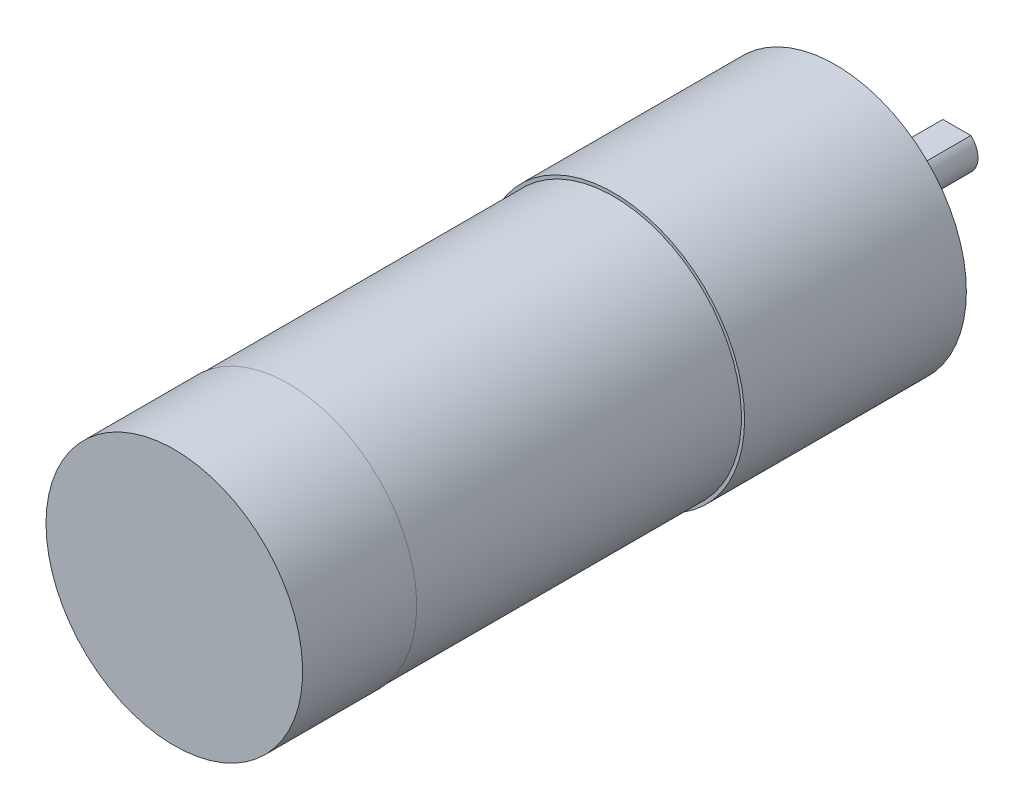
from build123d import *

# Parameters (mm, degrees)
SKETCH_1_R             = 12.4
EXTRUDE_1_DEPTH        = 21
SKETCH_2_R             = 12.1
EXTRUDE_2_DEPTH        = 30.8
SKETCH_3_R             = 12.15
EXTRUDE_3_DEPTH        = 10.8
SKETCH_4_R             = 3.5
EXTRUDE_4_DEPTH        = 2.5
SKETCH_5_R             = 2
EXTRUDE_5_DEPTH        = 9
CUT_EXTRUDE_START      = -9
CUT_EXTRUDE_1_DEPTH    = 9
HOLE_WIZARD_M3_1_D     = 2.5
HOLE_WIZARD_M3_1_DEPTH = 5
HOLE_WIZARD_M3_1_TIP   = 0.751075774


with BuildPart() as part:
    # Sketch 1 → Extrude 1 (new body)
    with BuildSketch(Plane.XY):
        with Locations(Location((0, 0, 0), (0, 0, 180))):
            Circle(SKETCH_1_R)
    extrude(amount=EXTRUDE_1_DEPTH)

    # Sketch 2 → Extrude 2 (add)
    with BuildSketch(Plane.XY.offset(21)):
        with Locations(Location((0, 0, 0), (0, 0, 180))):
            Circle(SKETCH_2_R)
    extrude(amount=EXTRUDE_2_DEPTH)

    # Sketch 3 → Extrude 3 (add)
    with BuildSketch(Plane.XY.offset(51.8)):
        with Locations(Location((0, 0, 0), (0, 0, 180))):
            Circle(SKETCH_3_R)
    extrude(amount=EXTRUDE_3_DEPTH)

    # Sketch 4 → Extrude 4 (add)
    with BuildSketch(Plane(origin=(0, 0, 0), x_dir=(-1, 0, 0), z_dir=(0, 0, -1))):
        Circle(SKETCH_4_R)
    extrude(amount=EXTRUDE_4_DEPTH)

    # Sketch 5 → Extrude 5 (add)
    with BuildSketch(Plane(origin=(0, 0, -2.5), x_dir=(-1, 0, 0), z_dir=(0, 0, -1))):
        Circle(SKETCH_5_R)
    extrude(amount=EXTRUDE_5_DEPTH)

    # Sketch 6 → Cut-Extrude 1 (cut)
    with BuildSketch(Plane(origin=(0, 0, -11.5), x_dir=(-1, 0, 0), z_dir=(0, 0, -1)).offset(CUT_EXTRUDE_START)):
        with BuildLine():
            Line((-1.322875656, 1.5), (1.322875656, 1.5))
            ThreePointArc((1.322875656, 1.5), (0, 2), (-1.322875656, 1.5))
        make_face()
    extrude(amount=CUT_EXTRUDE_1_DEPTH, mode=Mode.SUBTRACT)

    # Hole Wizard M3 _1
    with Locations(Plane(origin=(0, 0, 0), x_dir=(-1, 0, 0), z_dir=(0, 0, -1))):
        with Locations((-8.5, 0), (8.5, 0)):
            Hole(HOLE_WIZARD_M3_1_D / 2, depth=HOLE_WIZARD_M3_1_DEPTH)
            with Locations((0, 0, -(HOLE_WIZARD_M3_1_DEPTH + HOLE_WIZARD_M3_1_TIP / 2))):  # 118° drill point
                Cone(0, HOLE_WIZARD_M3_1_D / 2, HOLE_WIZARD_M3_1_TIP, mode=Mode.SUBTRACT)


solid = part.part
